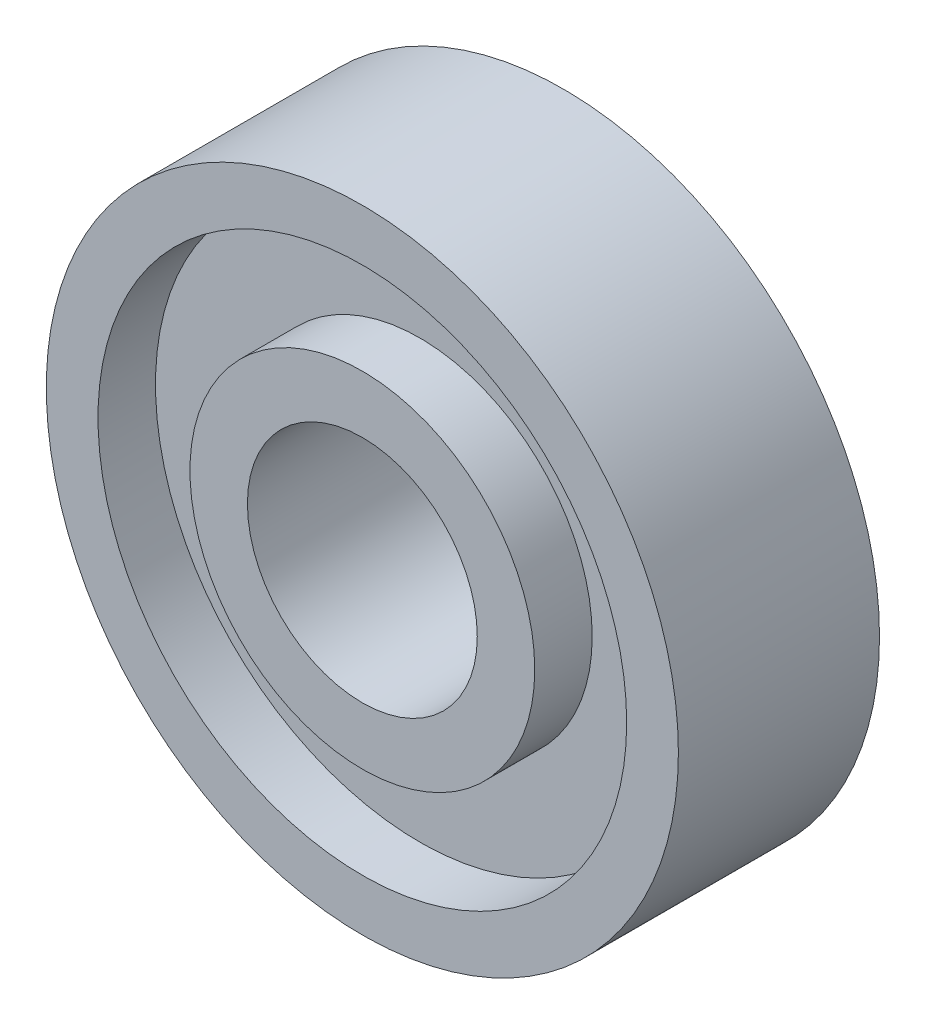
ISO-10303-21;
HEADER;
FILE_DESCRIPTION(('STEP AP214'),'2;1');
FILE_NAME('part.step','',(''),(''),'','','');
FILE_SCHEMA(('AUTOMOTIVE_DESIGN { 1 0 10303 214 1 1 1 1 }'));
ENDSEC;
DATA;
#1=APPLICATION_CONTEXT('core data for automotive mechanical design processes');
#2=APPLICATION_PROTOCOL_DEFINITION('international standard','automotive_design',2000,#1);
#3=PRODUCT_CONTEXT('',#1,'mechanical');
#4=PRODUCT('Part','Part','',(#3));
#5=PRODUCT_RELATED_PRODUCT_CATEGORY('part','',(#4));
#6=PRODUCT_DEFINITION_FORMATION('','',#4);
#7=PRODUCT_DEFINITION_CONTEXT('part definition',#1,'design');
#8=PRODUCT_DEFINITION('design','',#6,#7);
#9=PRODUCT_DEFINITION_SHAPE('','',#8);
#10=(LENGTH_UNIT() NAMED_UNIT(*) SI_UNIT(.MILLI.,.METRE.));
#11=(NAMED_UNIT(*) PLANE_ANGLE_UNIT() SI_UNIT($,.RADIAN.));
#12=(NAMED_UNIT(*) SI_UNIT($,.STERADIAN.) SOLID_ANGLE_UNIT());
#13=UNCERTAINTY_MEASURE_WITH_UNIT(LENGTH_MEASURE(1.E-05),#10,'distance_accuracy_value','');
#14=(GEOMETRIC_REPRESENTATION_CONTEXT(3) GLOBAL_UNCERTAINTY_ASSIGNED_CONTEXT((#13)) GLOBAL_UNIT_ASSIGNED_CONTEXT((#10,
#11,#12)) REPRESENTATION_CONTEXT('',''));
#15=CARTESIAN_POINT('',(0.,0.,0.));
#16=DIRECTION('',(0.,0.,1.));
#17=DIRECTION('',(1.,0.,0.));
#18=AXIS2_PLACEMENT_3D('',#15,#16,#17);
#19=CARTESIAN_POINT('',(0.,0.,3.5));
#20=DIRECTION('',(0.,0.,-1.));
#21=DIRECTION('',(-1.,0.,0.));
#22=AXIS2_PLACEMENT_3D('',#19,#20,#21);
#23=CYLINDRICAL_SURFACE('',#22,11.);
#24=CARTESIAN_POINT('',(0.,0.,3.5));
#25=DIRECTION('',(0.,0.,1.));
#26=DIRECTION('',(1.,0.,0.));
#27=AXIS2_PLACEMENT_3D('',#24,#25,#26);
#28=CIRCLE('',#27,11.);
#29=CARTESIAN_POINT('',(11.,0.,3.5));
#30=VERTEX_POINT('',#29);
#31=EDGE_CURVE('E10',#30,#30,#28,.T.);
#32=ORIENTED_EDGE('',*,*,#31,.F.);
#33=EDGE_LOOP('',(#32));
#34=FACE_BOUND('',#33,.T.);
#35=CARTESIAN_POINT('',(0.,0.,-3.5));
#36=DIRECTION('',(0.,0.,1.));
#37=DIRECTION('',(1.,0.,0.));
#38=AXIS2_PLACEMENT_3D('',#35,#36,#37);
#39=CIRCLE('',#38,11.);
#40=CARTESIAN_POINT('',(11.,0.,-3.5));
#41=VERTEX_POINT('',#40);
#42=EDGE_CURVE('E34',#41,#41,#39,.T.);
#43=ORIENTED_EDGE('',*,*,#42,.T.);
#44=EDGE_LOOP('',(#43));
#45=FACE_BOUND('',#44,.T.);
#46=ADVANCED_FACE('F31',(#34,#45),#23,.T.);
#47=CARTESIAN_POINT('',(0.,0.,3.5));
#48=DIRECTION('',(0.,0.,1.));
#49=DIRECTION('',(1.,0.,0.));
#50=AXIS2_PLACEMENT_3D('',#47,#48,#49);
#51=PLANE('',#50);
#52=CARTESIAN_POINT('',(0.,0.,3.5));
#53=DIRECTION('',(0.,0.,1.));
#54=DIRECTION('',(1.,0.,0.));
#55=AXIS2_PLACEMENT_3D('',#52,#53,#54);
#56=CIRCLE('',#55,9.2);
#57=CARTESIAN_POINT('',(9.2,0.,3.5));
#58=VERTEX_POINT('',#57);
#59=EDGE_CURVE('E43',#58,#58,#56,.T.);
#60=ORIENTED_EDGE('',*,*,#59,.F.);
#61=EDGE_LOOP('',(#60));
#62=FACE_BOUND('',#61,.T.);
#63=ORIENTED_EDGE('',*,*,#31,.T.);
#64=EDGE_LOOP('',(#63));
#65=FACE_BOUND('',#64,.T.);
#66=ADVANCED_FACE('F88',(#62,#65),#51,.T.);
#67=CARTESIAN_POINT('',(0.,0.,-3.5));
#68=DIRECTION('',(0.,0.,1.));
#69=DIRECTION('',(1.,0.,0.));
#70=AXIS2_PLACEMENT_3D('',#67,#68,#69);
#71=PLANE('',#70);
#72=CARTESIAN_POINT('',(0.,0.,-3.5));
#73=DIRECTION('',(0.,0.,1.));
#74=DIRECTION('',(1.,0.,0.));
#75=AXIS2_PLACEMENT_3D('',#72,#73,#74);
#76=CIRCLE('',#75,9.2);
#77=CARTESIAN_POINT('',(9.2,0.,-3.5));
#78=VERTEX_POINT('',#77);
#79=EDGE_CURVE('E55',#78,#78,#76,.T.);
#80=ORIENTED_EDGE('',*,*,#79,.T.);
#81=EDGE_LOOP('',(#80));
#82=FACE_BOUND('',#81,.T.);
#83=ORIENTED_EDGE('',*,*,#42,.F.);
#84=EDGE_LOOP('',(#83));
#85=FACE_BOUND('',#84,.T.);
#86=ADVANCED_FACE('F107',(#82,#85),#71,.F.);
#87=CARTESIAN_POINT('',(0.,0.,1.5));
#88=DIRECTION('',(0.,0.,1.));
#89=DIRECTION('',(1.,0.,0.));
#90=AXIS2_PLACEMENT_3D('',#87,#88,#89);
#91=CYLINDRICAL_SURFACE('',#90,9.2);
#92=CARTESIAN_POINT('',(0.,0.,1.5));
#93=DIRECTION('',(0.,0.,1.));
#94=DIRECTION('',(1.,0.,0.));
#95=AXIS2_PLACEMENT_3D('',#92,#93,#94);
#96=CIRCLE('',#95,9.2);
#97=CARTESIAN_POINT('',(9.2,0.,1.5));
#98=VERTEX_POINT('',#97);
#99=EDGE_CURVE('E41',#98,#98,#96,.T.);
#100=ORIENTED_EDGE('',*,*,#99,.F.);
#101=EDGE_LOOP('',(#100));
#102=FACE_BOUND('',#101,.T.);
#103=ORIENTED_EDGE('',*,*,#59,.T.);
#104=EDGE_LOOP('',(#103));
#105=FACE_BOUND('',#104,.T.);
#106=ADVANCED_FACE('F98',(#102,#105),#91,.F.);
#107=CARTESIAN_POINT('',(0.,0.,1.5));
#108=DIRECTION('',(0.,0.,1.));
#109=DIRECTION('',(1.,0.,0.));
#110=AXIS2_PLACEMENT_3D('',#107,#108,#109);
#111=PLANE('',#110);
#112=CARTESIAN_POINT('',(0.,0.,1.5));
#113=DIRECTION('',(0.,0.,1.));
#114=DIRECTION('',(1.,0.,0.));
#115=AXIS2_PLACEMENT_3D('',#112,#113,#114);
#116=CIRCLE('',#115,6.);
#117=CARTESIAN_POINT('',(6.,0.,1.5));
#118=VERTEX_POINT('',#117);
#119=EDGE_CURVE('E46',#118,#118,#116,.T.);
#120=ORIENTED_EDGE('',*,*,#119,.F.);
#121=EDGE_LOOP('',(#120));
#122=FACE_BOUND('',#121,.T.);
#123=ORIENTED_EDGE('',*,*,#99,.T.);
#124=EDGE_LOOP('',(#123));
#125=FACE_BOUND('',#124,.T.);
#126=ADVANCED_FACE('F92',(#122,#125),#111,.T.);
#127=CARTESIAN_POINT('',(0.,0.,1.5));
#128=DIRECTION('',(0.,0.,1.));
#129=DIRECTION('',(1.,0.,0.));
#130=AXIS2_PLACEMENT_3D('',#127,#128,#129);
#131=CYLINDRICAL_SURFACE('',#130,6.);
#132=ORIENTED_EDGE('',*,*,#119,.T.);
#133=EDGE_LOOP('',(#132));
#134=FACE_BOUND('',#133,.T.);
#135=CARTESIAN_POINT('',(0.,0.,3.5));
#136=DIRECTION('',(0.,0.,1.));
#137=DIRECTION('',(1.,0.,0.));
#138=AXIS2_PLACEMENT_3D('',#135,#136,#137);
#139=CIRCLE('',#138,6.);
#140=CARTESIAN_POINT('',(6.,0.,3.5));
#141=VERTEX_POINT('',#140);
#142=EDGE_CURVE('E49',#141,#141,#139,.T.);
#143=ORIENTED_EDGE('',*,*,#142,.F.);
#144=EDGE_LOOP('',(#143));
#145=FACE_BOUND('',#144,.T.);
#146=ADVANCED_FACE('F86',(#134,#145),#131,.T.);
#147=CARTESIAN_POINT('',(0.,0.,3.5));
#148=DIRECTION('',(0.,0.,1.));
#149=DIRECTION('',(1.,0.,0.));
#150=AXIS2_PLACEMENT_3D('',#147,#148,#149);
#151=CIRCLE('',#150,4.);
#152=CARTESIAN_POINT('',(4.,0.,3.5));
#153=VERTEX_POINT('',#152);
#154=EDGE_CURVE('E67',#153,#153,#151,.T.);
#155=ORIENTED_EDGE('',*,*,#154,.F.);
#156=EDGE_LOOP('',(#155));
#157=FACE_BOUND('',#156,.T.);
#158=ORIENTED_EDGE('',*,*,#142,.T.);
#159=EDGE_LOOP('',(#158));
#160=FACE_BOUND('',#159,.T.);
#161=ADVANCED_FACE('F82',(#157,#160),#51,.T.);
#162=CARTESIAN_POINT('',(0.,0.,-1.5));
#163=DIRECTION('',(0.,0.,-1.));
#164=DIRECTION('',(1.,0.,0.));
#165=AXIS2_PLACEMENT_3D('',#162,#163,#164);
#166=PLANE('',#165);
#167=CARTESIAN_POINT('',(0.,0.,-1.5));
#168=DIRECTION('',(0.,0.,1.));
#169=DIRECTION('',(1.,0.,0.));
#170=AXIS2_PLACEMENT_3D('',#167,#168,#169);
#171=CIRCLE('',#170,9.2);
#172=CARTESIAN_POINT('',(9.2,0.,-1.5));
#173=VERTEX_POINT('',#172);
#174=EDGE_CURVE('E52',#173,#173,#171,.T.);
#175=ORIENTED_EDGE('',*,*,#174,.F.);
#176=EDGE_LOOP('',(#175));
#177=FACE_BOUND('',#176,.T.);
#178=CARTESIAN_POINT('',(0.,0.,-1.5));
#179=DIRECTION('',(0.,0.,1.));
#180=DIRECTION('',(1.,0.,0.));
#181=AXIS2_PLACEMENT_3D('',#178,#179,#180);
#182=CIRCLE('',#181,6.);
#183=CARTESIAN_POINT('',(6.,0.,-1.5));
#184=VERTEX_POINT('',#183);
#185=EDGE_CURVE('E58',#184,#184,#182,.T.);
#186=ORIENTED_EDGE('',*,*,#185,.T.);
#187=EDGE_LOOP('',(#186));
#188=FACE_BOUND('',#187,.T.);
#189=ADVANCED_FACE('F85',(#177,#188),#166,.T.);
#190=CARTESIAN_POINT('',(0.,0.,-1.5));
#191=DIRECTION('',(0.,0.,-1.));
#192=DIRECTION('',(-1.,0.,0.));
#193=AXIS2_PLACEMENT_3D('',#190,#191,#192);
#194=CYLINDRICAL_SURFACE('',#193,9.2);
#195=ORIENTED_EDGE('',*,*,#174,.T.);
#196=EDGE_LOOP('',(#195));
#197=FACE_BOUND('',#196,.T.);
#198=ORIENTED_EDGE('',*,*,#79,.F.);
#199=EDGE_LOOP('',(#198));
#200=FACE_BOUND('',#199,.T.);
#201=ADVANCED_FACE('F124',(#197,#200),#194,.F.);
#202=CARTESIAN_POINT('',(0.,0.,-1.5));
#203=DIRECTION('',(0.,0.,-1.));
#204=DIRECTION('',(-1.,0.,0.));
#205=AXIS2_PLACEMENT_3D('',#202,#203,#204);
#206=CYLINDRICAL_SURFACE('',#205,6.);
#207=ORIENTED_EDGE('',*,*,#185,.F.);
#208=EDGE_LOOP('',(#207));
#209=FACE_BOUND('',#208,.T.);
#210=CARTESIAN_POINT('',(0.,0.,-3.5));
#211=DIRECTION('',(0.,0.,1.));
#212=DIRECTION('',(1.,0.,0.));
#213=AXIS2_PLACEMENT_3D('',#210,#211,#212);
#214=CIRCLE('',#213,6.);
#215=CARTESIAN_POINT('',(6.,0.,-3.5));
#216=VERTEX_POINT('',#215);
#217=EDGE_CURVE('E61',#216,#216,#214,.T.);
#218=ORIENTED_EDGE('',*,*,#217,.T.);
#219=EDGE_LOOP('',(#218));
#220=FACE_BOUND('',#219,.T.);
#221=ADVANCED_FACE('F120',(#209,#220),#206,.T.);
#222=CARTESIAN_POINT('',(0.,0.,-3.5));
#223=DIRECTION('',(0.,0.,1.));
#224=DIRECTION('',(1.,0.,0.));
#225=AXIS2_PLACEMENT_3D('',#222,#223,#224);
#226=CIRCLE('',#225,4.);
#227=CARTESIAN_POINT('',(4.,0.,-3.5));
#228=VERTEX_POINT('',#227);
#229=EDGE_CURVE('E64',#228,#228,#226,.T.);
#230=ORIENTED_EDGE('',*,*,#229,.T.);
#231=EDGE_LOOP('',(#230));
#232=FACE_BOUND('',#231,.T.);
#233=ORIENTED_EDGE('',*,*,#217,.F.);
#234=EDGE_LOOP('',(#233));
#235=FACE_BOUND('',#234,.T.);
#236=ADVANCED_FACE('F73',(#232,#235),#71,.F.);
#237=CARTESIAN_POINT('',(0.,0.,-3.5));
#238=DIRECTION('',(0.,0.,1.));
#239=DIRECTION('',(1.,0.,0.));
#240=AXIS2_PLACEMENT_3D('',#237,#238,#239);
#241=CYLINDRICAL_SURFACE('',#240,4.);
#242=ORIENTED_EDGE('',*,*,#229,.F.);
#243=EDGE_LOOP('',(#242));
#244=FACE_BOUND('',#243,.T.);
#245=ORIENTED_EDGE('',*,*,#154,.T.);
#246=EDGE_LOOP('',(#245));
#247=FACE_BOUND('',#246,.T.);
#248=ADVANCED_FACE('F76',(#244,#247),#241,.F.);
#249=CLOSED_SHELL('',(#46,#66,#86,#106,#126,#146,#161,#189,#201,#221,#236,#248));
#250=MANIFOLD_SOLID_BREP('B2',#249);
#251=ADVANCED_BREP_SHAPE_REPRESENTATION('',(#18,#250),#14);
#252=SHAPE_DEFINITION_REPRESENTATION(#9,#251);
ENDSEC;
END-ISO-10303-21;
